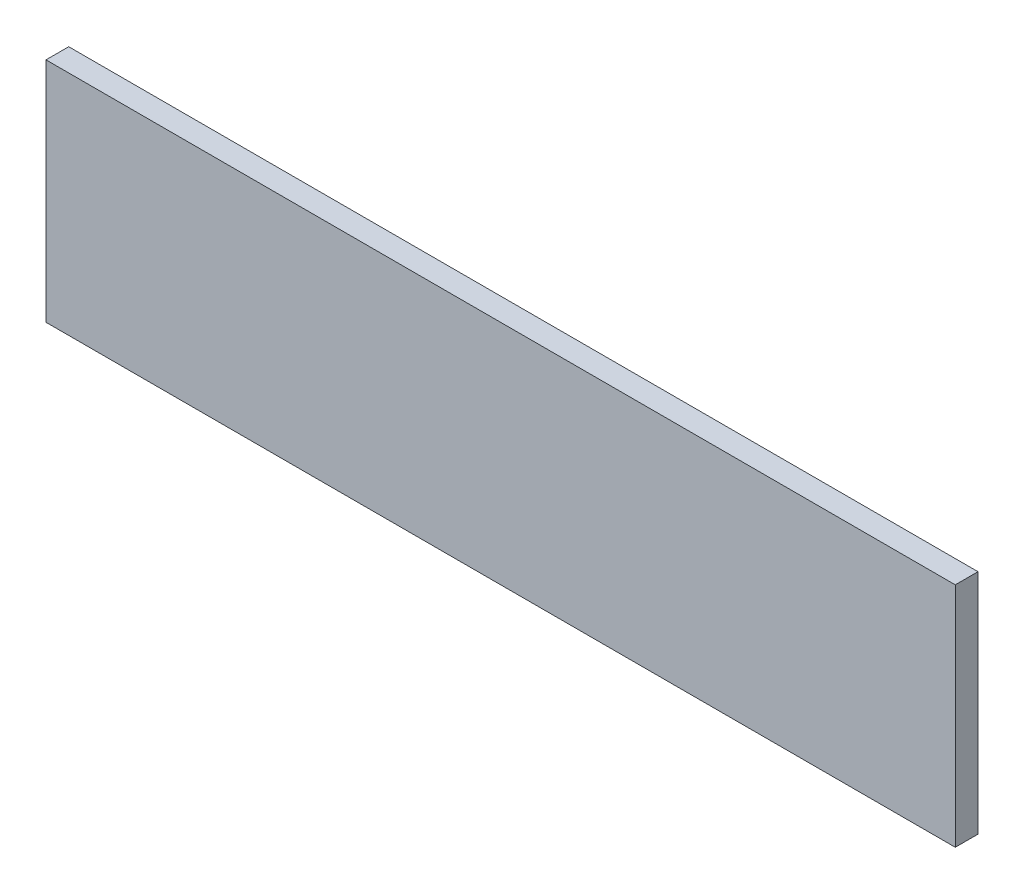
ISO-10303-21;
HEADER;
FILE_DESCRIPTION(('STEP AP214'),'2;1');
FILE_NAME('part.step','',(''),(''),'','','');
FILE_SCHEMA(('AUTOMOTIVE_DESIGN { 1 0 10303 214 1 1 1 1 }'));
ENDSEC;
DATA;
#1=APPLICATION_CONTEXT('core data for automotive mechanical design processes');
#2=APPLICATION_PROTOCOL_DEFINITION('international standard','automotive_design',2000,#1);
#3=PRODUCT_CONTEXT('',#1,'mechanical');
#4=PRODUCT('Part','Part','',(#3));
#5=PRODUCT_RELATED_PRODUCT_CATEGORY('part','',(#4));
#6=PRODUCT_DEFINITION_FORMATION('','',#4);
#7=PRODUCT_DEFINITION_CONTEXT('part definition',#1,'design');
#8=PRODUCT_DEFINITION('design','',#6,#7);
#9=PRODUCT_DEFINITION_SHAPE('','',#8);
#10=(LENGTH_UNIT() NAMED_UNIT(*) SI_UNIT(.MILLI.,.METRE.));
#11=(NAMED_UNIT(*) PLANE_ANGLE_UNIT() SI_UNIT($,.RADIAN.));
#12=(NAMED_UNIT(*) SI_UNIT($,.STERADIAN.) SOLID_ANGLE_UNIT());
#13=UNCERTAINTY_MEASURE_WITH_UNIT(LENGTH_MEASURE(1.E-05),#10,'distance_accuracy_value','');
#14=(GEOMETRIC_REPRESENTATION_CONTEXT(3) GLOBAL_UNCERTAINTY_ASSIGNED_CONTEXT((#13)) GLOBAL_UNIT_ASSIGNED_CONTEXT((#10,
#11,#12)) REPRESENTATION_CONTEXT('',''));
#15=CARTESIAN_POINT('',(0.,0.,0.));
#16=DIRECTION('',(0.,0.,1.));
#17=DIRECTION('',(1.,0.,0.));
#18=AXIS2_PLACEMENT_3D('',#15,#16,#17);
#19=CARTESIAN_POINT('',(-120.,-30.,3.));
#20=DIRECTION('',(1.,0.,0.));
#21=DIRECTION('',(0.,0.,-1.));
#22=AXIS2_PLACEMENT_3D('',#19,#20,#21);
#23=PLANE('',#22);
#24=DIRECTION('',(0.,-1.,0.));
#25=VECTOR('',#24,1.);
#26=CARTESIAN_POINT('',(-120.,-30.,-3.));
#27=LINE('',#26,#25);
#28=CARTESIAN_POINT('',(-120.,30.,-3.));
#29=VERTEX_POINT('',#28);
#30=CARTESIAN_POINT('',(-120.,-30.,-3.));
#31=VERTEX_POINT('',#30);
#32=EDGE_CURVE('E83',#29,#31,#27,.T.);
#33=ORIENTED_EDGE('',*,*,#32,.T.);
#34=DIRECTION('',(0.,0.,-1.));
#35=VECTOR('',#34,1.);
#36=CARTESIAN_POINT('',(-120.,-30.,3.));
#37=LINE('',#36,#35);
#38=CARTESIAN_POINT('',(-120.,-30.,3.));
#39=VERTEX_POINT('',#38);
#40=EDGE_CURVE('E11',#39,#31,#37,.T.);
#41=ORIENTED_EDGE('',*,*,#40,.F.);
#42=DIRECTION('',(0.,-1.,0.));
#43=VECTOR('',#42,1.);
#44=CARTESIAN_POINT('',(-120.,-30.,3.));
#45=LINE('',#44,#43);
#46=CARTESIAN_POINT('',(-120.,30.,3.));
#47=VERTEX_POINT('',#46);
#48=EDGE_CURVE('E101',#47,#39,#45,.T.);
#49=ORIENTED_EDGE('',*,*,#48,.F.);
#50=DIRECTION('',(0.,0.,-1.));
#51=VECTOR('',#50,1.);
#52=CARTESIAN_POINT('',(-120.,30.,3.));
#53=LINE('',#52,#51);
#54=EDGE_CURVE('E95',#47,#29,#53,.T.);
#55=ORIENTED_EDGE('',*,*,#54,.T.);
#56=EDGE_LOOP('',(#33,#41,#49,#55));
#57=FACE_BOUND('',#56,.T.);
#58=ADVANCED_FACE('F39',(#57),#23,.F.);
#59=CARTESIAN_POINT('',(-120.,-30.,3.));
#60=DIRECTION('',(0.,1.,0.));
#61=DIRECTION('',(-1.,0.,0.));
#62=AXIS2_PLACEMENT_3D('',#59,#60,#61);
#63=PLANE('',#62);
#64=DIRECTION('',(1.,0.,0.));
#65=VECTOR('',#64,1.);
#66=CARTESIAN_POINT('',(-120.,-30.,-3.));
#67=LINE('',#66,#65);
#68=CARTESIAN_POINT('',(120.,-30.,-3.));
#69=VERTEX_POINT('',#68);
#70=EDGE_CURVE('E79',#31,#69,#67,.T.);
#71=ORIENTED_EDGE('',*,*,#70,.T.);
#72=DIRECTION('',(0.,0.,-1.));
#73=VECTOR('',#72,1.);
#74=CARTESIAN_POINT('',(120.,-30.,3.));
#75=LINE('',#74,#73);
#76=CARTESIAN_POINT('',(120.,-30.,3.));
#77=VERTEX_POINT('',#76);
#78=EDGE_CURVE('E46',#77,#69,#75,.T.);
#79=ORIENTED_EDGE('',*,*,#78,.F.);
#80=DIRECTION('',(1.,0.,0.));
#81=VECTOR('',#80,1.);
#82=CARTESIAN_POINT('',(-120.,-30.,3.));
#83=LINE('',#82,#81);
#84=EDGE_CURVE('E91',#39,#77,#83,.T.);
#85=ORIENTED_EDGE('',*,*,#84,.F.);
#86=ORIENTED_EDGE('',*,*,#40,.T.);
#87=EDGE_LOOP('',(#71,#79,#85,#86));
#88=FACE_BOUND('',#87,.T.);
#89=ADVANCED_FACE('F90',(#88),#63,.F.);
#90=CARTESIAN_POINT('',(120.,-30.,3.));
#91=DIRECTION('',(-1.,0.,0.));
#92=DIRECTION('',(0.,-1.,0.));
#93=AXIS2_PLACEMENT_3D('',#90,#91,#92);
#94=PLANE('',#93);
#95=DIRECTION('',(0.,1.,0.));
#96=VECTOR('',#95,1.);
#97=CARTESIAN_POINT('',(120.,-30.,-3.));
#98=LINE('',#97,#96);
#99=CARTESIAN_POINT('',(120.,30.,-3.));
#100=VERTEX_POINT('',#99);
#101=EDGE_CURVE('E84',#69,#100,#98,.T.);
#102=ORIENTED_EDGE('',*,*,#101,.T.);
#103=DIRECTION('',(0.,0.,-1.));
#104=VECTOR('',#103,1.);
#105=CARTESIAN_POINT('',(120.,30.,3.));
#106=LINE('',#105,#104);
#107=CARTESIAN_POINT('',(120.,30.,3.));
#108=VERTEX_POINT('',#107);
#109=EDGE_CURVE('E107',#108,#100,#106,.T.);
#110=ORIENTED_EDGE('',*,*,#109,.F.);
#111=DIRECTION('',(0.,1.,0.));
#112=VECTOR('',#111,1.);
#113=CARTESIAN_POINT('',(120.,-30.,3.));
#114=LINE('',#113,#112);
#115=EDGE_CURVE('E58',#77,#108,#114,.T.);
#116=ORIENTED_EDGE('',*,*,#115,.F.);
#117=ORIENTED_EDGE('',*,*,#78,.T.);
#118=EDGE_LOOP('',(#102,#110,#116,#117));
#119=FACE_BOUND('',#118,.T.);
#120=ADVANCED_FACE('F110',(#119),#94,.F.);
#121=CARTESIAN_POINT('',(-120.,30.,3.));
#122=DIRECTION('',(0.,-1.,0.));
#123=DIRECTION('',(1.,0.,0.));
#124=AXIS2_PLACEMENT_3D('',#121,#122,#123);
#125=PLANE('',#124);
#126=DIRECTION('',(-1.,0.,0.));
#127=VECTOR('',#126,1.);
#128=CARTESIAN_POINT('',(-120.,30.,-3.));
#129=LINE('',#128,#127);
#130=EDGE_CURVE('E99',#100,#29,#129,.T.);
#131=ORIENTED_EDGE('',*,*,#130,.T.);
#132=ORIENTED_EDGE('',*,*,#54,.F.);
#133=DIRECTION('',(-1.,0.,0.));
#134=VECTOR('',#133,1.);
#135=CARTESIAN_POINT('',(-120.,30.,3.));
#136=LINE('',#135,#134);
#137=EDGE_CURVE('E53',#108,#47,#136,.T.);
#138=ORIENTED_EDGE('',*,*,#137,.F.);
#139=ORIENTED_EDGE('',*,*,#109,.T.);
#140=EDGE_LOOP('',(#131,#132,#138,#139));
#141=FACE_BOUND('',#140,.T.);
#142=ADVANCED_FACE('F112',(#141),#125,.F.);
#143=CARTESIAN_POINT('',(-120.,30.,3.));
#144=DIRECTION('',(0.,0.,-1.));
#145=DIRECTION('',(-1.,0.,0.));
#146=AXIS2_PLACEMENT_3D('',#143,#144,#145);
#147=PLANE('',#146);
#148=ORIENTED_EDGE('',*,*,#48,.T.);
#149=ORIENTED_EDGE('',*,*,#84,.T.);
#150=ORIENTED_EDGE('',*,*,#115,.T.);
#151=ORIENTED_EDGE('',*,*,#137,.T.);
#152=EDGE_LOOP('',(#148,#149,#150,#151));
#153=FACE_BOUND('',#152,.T.);
#154=ADVANCED_FACE('F113',(#153),#147,.F.);
#155=CARTESIAN_POINT('',(-120.,30.,-3.));
#156=DIRECTION('',(0.,0.,-1.));
#157=DIRECTION('',(-1.,0.,0.));
#158=AXIS2_PLACEMENT_3D('',#155,#156,#157);
#159=PLANE('',#158);
#160=ORIENTED_EDGE('',*,*,#32,.F.);
#161=ORIENTED_EDGE('',*,*,#130,.F.);
#162=ORIENTED_EDGE('',*,*,#101,.F.);
#163=ORIENTED_EDGE('',*,*,#70,.F.);
#164=EDGE_LOOP('',(#160,#161,#162,#163));
#165=FACE_BOUND('',#164,.T.);
#166=ADVANCED_FACE('F80',(#165),#159,.T.);
#167=CLOSED_SHELL('',(#58,#89,#120,#142,#154,#166));
#168=MANIFOLD_SOLID_BREP('B2',#167);
#169=ADVANCED_BREP_SHAPE_REPRESENTATION('',(#18,#168),#14);
#170=SHAPE_DEFINITION_REPRESENTATION(#9,#169);
ENDSEC;
END-ISO-10303-21;
